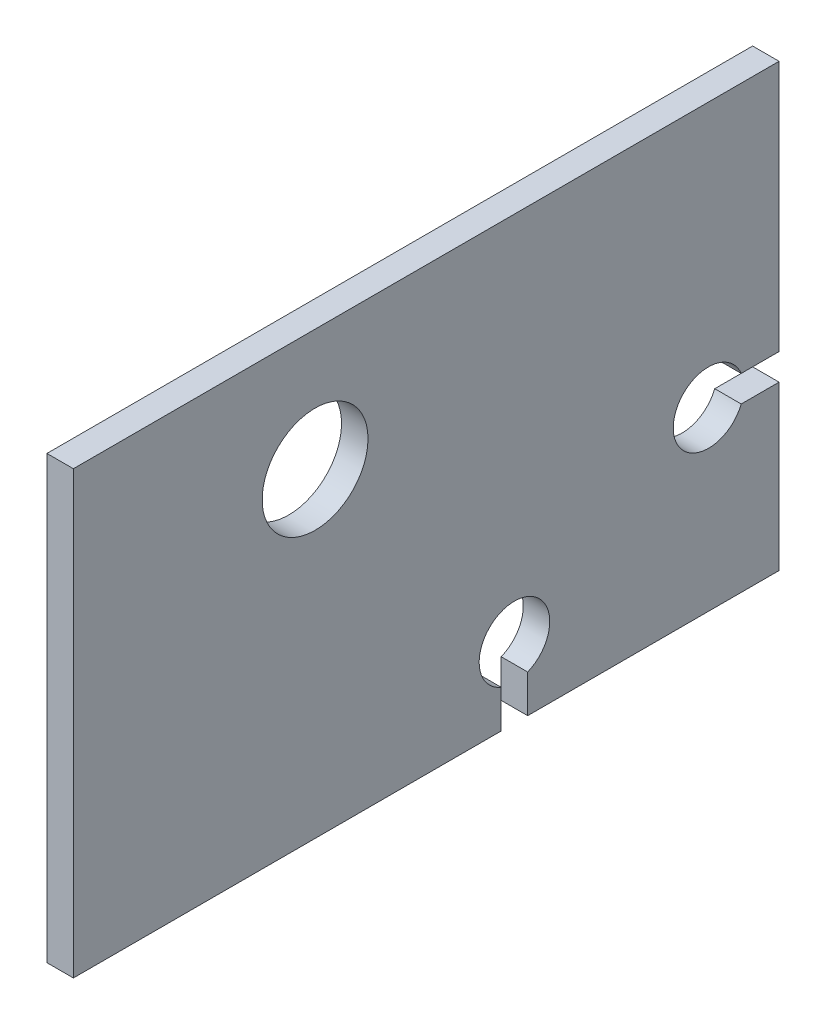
from build123d import *

# Parameters (mm, degrees)
ESQUISSE1_R          = 6
BASE_EXTRUSION_DEPTH = 1.5


with BuildPart() as part:
    # Esquisse1 → Base-Extrusion (new, symmetric)
    with BuildSketch(Plane(origin=(0, 0, 0), x_dir=(0, 0, -1), z_dir=(1, 0, 0))):
        with BuildLine():
            Line((75.708099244, 21.5), (80, 21.5))
            Line((80, 21.5), (80, 50))
            Line((80, 50), (0, 50))
            Line((0, 50), (0, 0))
            Line((0, 0), (48.5, 0))
            Line((48.5, 0), (48.5, 4.291900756))
            ThreePointArc((48.5, 4.291900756), (50, 12), (51.5, 4.291900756))
            Line((51.5, 4.291900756), (51.5, 0))
            Line((51.5, 0), (80, 0))
            Line((80, 0), (80, 18.5))
            Line((80, 18.5), (75.708099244, 18.5))
            ThreePointArc((75.708099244, 18.5), (68, 20), (75.708099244, 21.5))
        make_face()
        with Locations((27.4, 36.25)):
            Circle(ESQUISSE1_R, mode=Mode.SUBTRACT)
    extrude(amount=BASE_EXTRUSION_DEPTH, both=True)


solid = part.part
